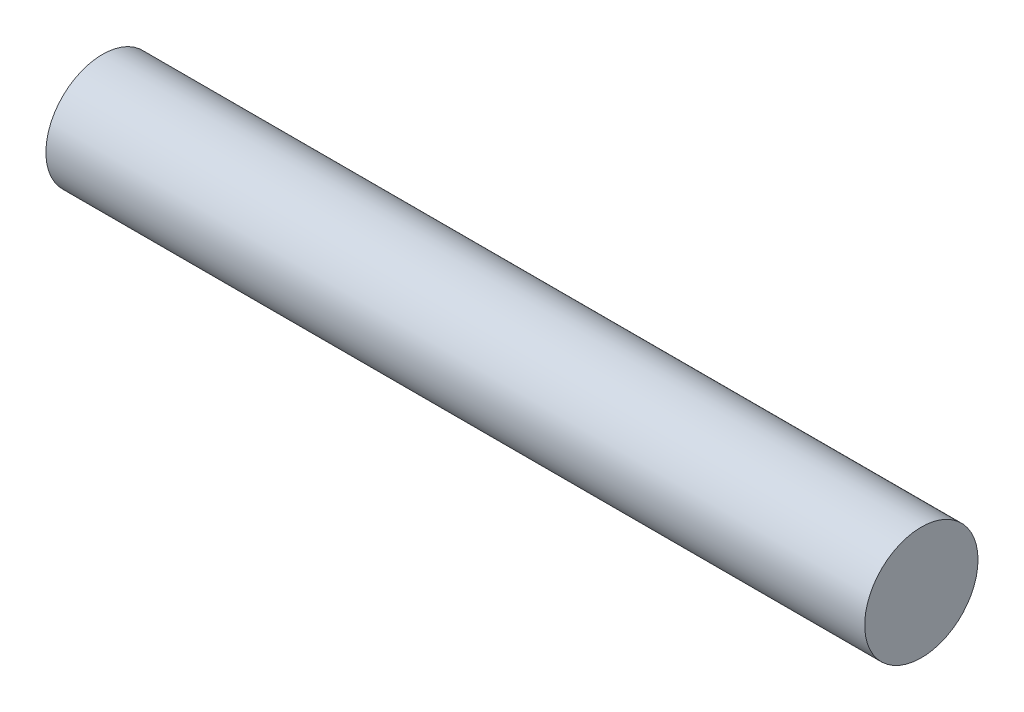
from build123d import *

# Parameters (mm, degrees)
SKETCH_1_R      = 0.65024
EXTRUDE_1_DEPTH = 4.699


with BuildPart() as part:
    # Sketch 1 → Extrude 1 (new, symmetric)
    with BuildSketch(Plane(origin=(0, 0, 0), x_dir=(0, 0, -1), z_dir=(1, 0, 0))):
        Circle(SKETCH_1_R)
    extrude(amount=EXTRUDE_1_DEPTH, both=True)


solid = part.part
